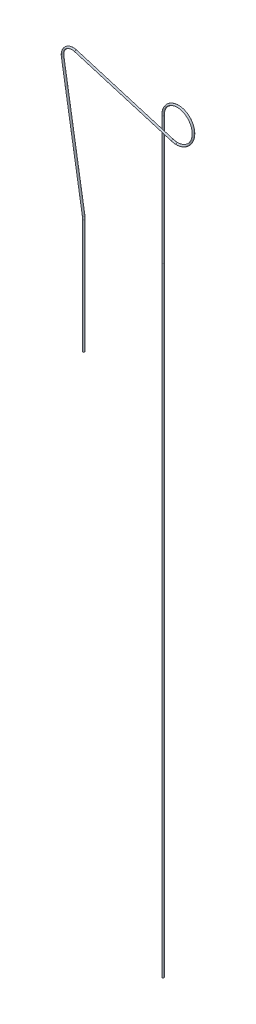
from build123d import *

# Parameters (mm, degrees)
SKETCH_2_R          = 1.495
SWEEP_2_PITCH       = 4
SWEEP_2_HEIGHT      = 3
SWEEP_2_RADIUS      = 25.5
SWEEP_2_START_ANGLE = -90
SKETCH_4_R          = 1.495
SKETCH_5_R          = 1.495


with BuildPart() as part:
    # Sweep 1: sweep along a path in Sketch 1
    with BuildLine(Plane.XY) as sweep_1_path:
        Line((-62.5, -340.884572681), (-62.5, -155.884572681))
        ThreePointArc((-62.5, -155.884572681), (-62.591552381, -153.642475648), (-62.865599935, -151.415307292))
        Line((-62.865599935, -151.415307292), (-96.840906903, 54.860107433))
        ThreePointArc((-96.840906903, 54.860107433), (-91.459298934, 69.929608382), (-75.827133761, 73.348230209))
        Line((-75.827133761, 73.348230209), (80.803242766, 26.446674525))
        ThreePointArc((80.803242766, 26.446674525), (84.421620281, 25.644341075), (88.118084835, 25.375))
    # Sketch 2 → Sweep 1 (sweep)
    with BuildSketch(Plane(origin=(0, -340.884572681, 0), x_dir=(-1, 0, 0), z_dir=(0, 1, 0))):
        with Locations((62.5, 0)):
            Circle(SKETCH_2_R)
    sweep(path=sweep_1_path.line)

    # Sweep 2: sweep along a helix
    with BuildLine() as sweep_2_path:
        add(Helix(SWEEP_2_PITCH, SWEEP_2_HEIGHT, SWEEP_2_RADIUS, center=(88.118084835, 50.875, 0), direction=(0, 0, -1), lefthand=True, mode=Mode.PRIVATE).rotate(Axis((88.118084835, 50.875, 0), (0, 0, -1)), SWEEP_2_START_ANGLE))
    # Sketch 4 → Sweep 2 (sweep)
    with BuildSketch(Plane(origin=(88.118084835, 0, 0), x_dir=(0, 0, -1), z_dir=(1, 0, 0))):
        with Locations((0, 25.375)):
            Circle(SKETCH_4_R)
    sweep(path=sweep_2_path.line, is_frenet=True)

    # Sweep 4: sweep along a path in Sketch 6
    with BuildLine(Plane.XY.offset(-3)) as sweep_4_path:
        Line((62.618088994, 50.889563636), (62.500004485, -155.868866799))
        Line((62.500004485, -155.868866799), (62.5, -1155.868866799))
    # Sketch 5 → Sweep 4 (sweep)
    with BuildSketch(Plane.XZ.offset(-50.875)):
        with Locations((62.618084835, -3)):
            Circle(SKETCH_5_R)
    sweep(path=sweep_4_path.line, transition=Transition.RIGHT)


solid = part.part
